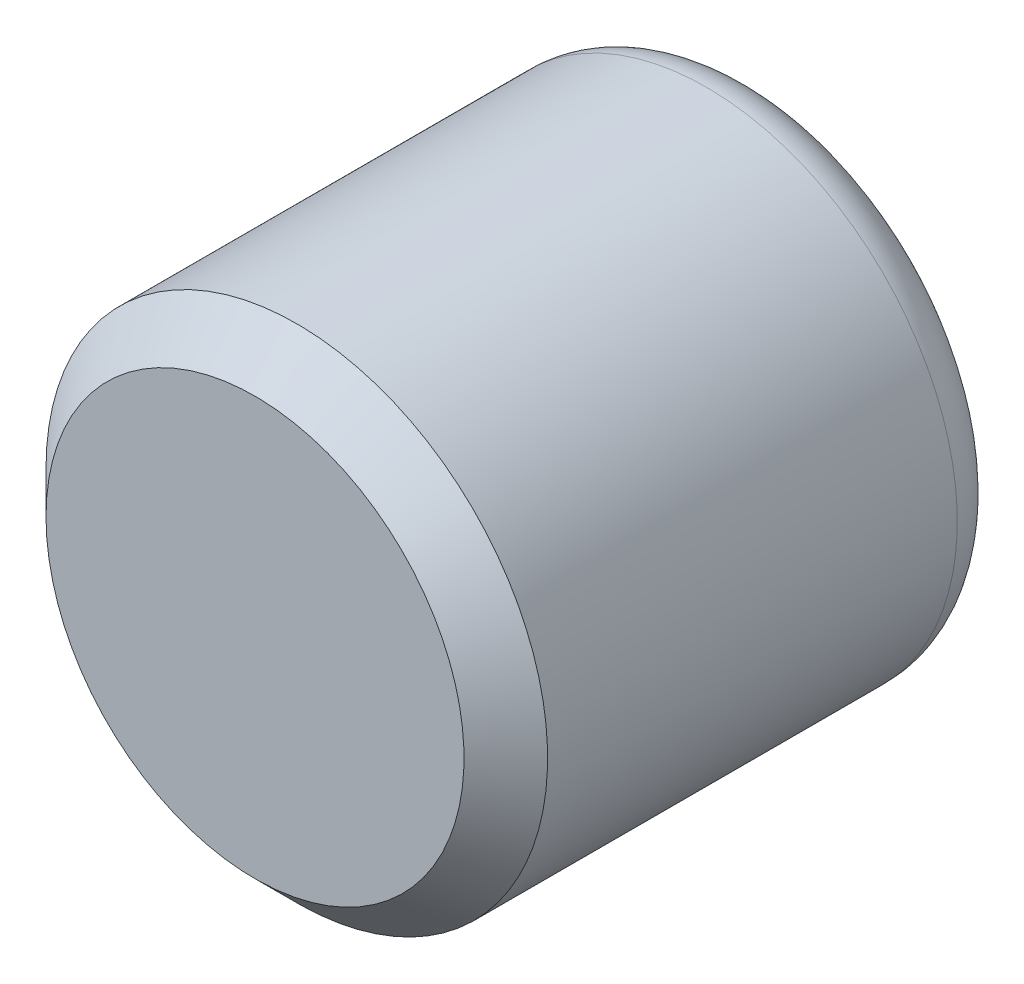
ISO-10303-21;
HEADER;
FILE_DESCRIPTION(('STEP AP214'),'2;1');
FILE_NAME('part.step','',(''),(''),'','','');
FILE_SCHEMA(('AUTOMOTIVE_DESIGN { 1 0 10303 214 1 1 1 1 }'));
ENDSEC;
DATA;
#1=APPLICATION_CONTEXT('core data for automotive mechanical design processes');
#2=APPLICATION_PROTOCOL_DEFINITION('international standard','automotive_design',2000,#1);
#3=PRODUCT_CONTEXT('',#1,'mechanical');
#4=PRODUCT('Part','Part','',(#3));
#5=PRODUCT_RELATED_PRODUCT_CATEGORY('part','',(#4));
#6=PRODUCT_DEFINITION_FORMATION('','',#4);
#7=PRODUCT_DEFINITION_CONTEXT('part definition',#1,'design');
#8=PRODUCT_DEFINITION('design','',#6,#7);
#9=PRODUCT_DEFINITION_SHAPE('','',#8);
#10=(LENGTH_UNIT() NAMED_UNIT(*) SI_UNIT(.MILLI.,.METRE.));
#11=(NAMED_UNIT(*) PLANE_ANGLE_UNIT() SI_UNIT($,.RADIAN.));
#12=(NAMED_UNIT(*) SI_UNIT($,.STERADIAN.) SOLID_ANGLE_UNIT());
#13=UNCERTAINTY_MEASURE_WITH_UNIT(LENGTH_MEASURE(1.E-05),#10,'distance_accuracy_value','');
#14=(GEOMETRIC_REPRESENTATION_CONTEXT(3) GLOBAL_UNCERTAINTY_ASSIGNED_CONTEXT((#13)) GLOBAL_UNIT_ASSIGNED_CONTEXT((#10,
#11,#12)) REPRESENTATION_CONTEXT('',''));
#15=CARTESIAN_POINT('',(0.,0.,0.));
#16=DIRECTION('',(0.,0.,1.));
#17=DIRECTION('',(1.,0.,0.));
#18=AXIS2_PLACEMENT_3D('',#15,#16,#17);
#19=CARTESIAN_POINT('',(0.,0.,-6.));
#20=DIRECTION('',(0.,0.,1.));
#21=DIRECTION('',(1.,0.,0.));
#22=AXIS2_PLACEMENT_3D('',#19,#20,#21);
#23=PLANE('',#22);
#24=CARTESIAN_POINT('',(0.,0.,-6.));
#25=DIRECTION('',(0.,0.,-1.));
#26=DIRECTION('',(-1.,0.,0.));
#27=AXIS2_PLACEMENT_3D('',#24,#25,#26);
#28=CIRCLE('',#27,2.4);
#29=CARTESIAN_POINT('',(-2.4,0.,-6.));
#30=VERTEX_POINT('',#29);
#31=EDGE_CURVE('E134',#30,#30,#28,.T.);
#32=ORIENTED_EDGE('',*,*,#31,.T.);
#33=EDGE_LOOP('',(#32));
#34=FACE_BOUND('',#33,.T.);
#35=DIRECTION('',(-0.86602540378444,0.499999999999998,0.));
#36=VECTOR('',#35,1.);
#37=CARTESIAN_POINT('',(0.,2.3094010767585,-6.));
#38=LINE('',#37,#36);
#39=CARTESIAN_POINT('',(2.,1.15470053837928,-6.));
#40=VERTEX_POINT('',#39);
#41=CARTESIAN_POINT('',(0.,2.3094010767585,-6.));
#42=VERTEX_POINT('',#41);
#43=EDGE_CURVE('E44',#40,#42,#38,.T.);
#44=ORIENTED_EDGE('',*,*,#43,.T.);
#45=DIRECTION('',(-0.866025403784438,-0.500000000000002,0.));
#46=VECTOR('',#45,1.);
#47=CARTESIAN_POINT('',(0.,2.3094010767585,-6.));
#48=LINE('',#47,#46);
#49=CARTESIAN_POINT('',(-1.99999999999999,1.15470053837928,-6.));
#50=VERTEX_POINT('',#49);
#51=EDGE_CURVE('E84',#42,#50,#48,.T.);
#52=ORIENTED_EDGE('',*,*,#51,.T.);
#53=DIRECTION('',(0.,-1.,0.));
#54=VECTOR('',#53,1.);
#55=CARTESIAN_POINT('',(-2.00000000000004,-1.15470053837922,-6.));
#56=LINE('',#55,#54);
#57=CARTESIAN_POINT('',(-2.00000000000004,-1.15470053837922,-6.));
#58=VERTEX_POINT('',#57);
#59=EDGE_CURVE('E92',#50,#58,#56,.T.);
#60=ORIENTED_EDGE('',*,*,#59,.T.);
#61=DIRECTION('',(0.866025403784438,-0.500000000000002,0.));
#62=VECTOR('',#61,1.);
#63=CARTESIAN_POINT('',(0.,-2.30940107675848,-6.));
#64=LINE('',#63,#62);
#65=CARTESIAN_POINT('',(0.,-2.30940107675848,-6.));
#66=VERTEX_POINT('',#65);
#67=EDGE_CURVE('E107',#58,#66,#64,.T.);
#68=ORIENTED_EDGE('',*,*,#67,.T.);
#69=DIRECTION('',(0.866025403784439,0.499999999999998,0.));
#70=VECTOR('',#69,1.);
#71=CARTESIAN_POINT('',(0.,-2.30940107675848,-6.));
#72=LINE('',#71,#70);
#73=CARTESIAN_POINT('',(1.99999999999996,-1.15470053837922,-6.));
#74=VERTEX_POINT('',#73);
#75=EDGE_CURVE('E110',#66,#74,#72,.T.);
#76=ORIENTED_EDGE('',*,*,#75,.T.);
#77=DIRECTION('',(0.,1.,0.));
#78=VECTOR('',#77,1.);
#79=CARTESIAN_POINT('',(1.99999999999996,-1.15470053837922,-6.));
#80=LINE('',#79,#78);
#81=EDGE_CURVE('E103',#74,#40,#80,.T.);
#82=ORIENTED_EDGE('',*,*,#81,.T.);
#83=EDGE_LOOP('',(#44,#52,#60,#68,#76,#82));
#84=FACE_BOUND('',#83,.T.);
#85=ADVANCED_FACE('F30',(#34,#84),#23,.F.);
#86=CARTESIAN_POINT('',(0.,0.,-5.4));
#87=DIRECTION('',(0.,0.,-1.));
#88=DIRECTION('',(-1.,0.,0.));
#89=AXIS2_PLACEMENT_3D('',#86,#87,#88);
#90=TOROIDAL_SURFACE('',#89,2.4,0.599999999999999);
#91=ORIENTED_EDGE('',*,*,#31,.F.);
#92=EDGE_LOOP('',(#91));
#93=FACE_BOUND('',#92,.T.);
#94=CARTESIAN_POINT('',(0.,0.,-5.4));
#95=DIRECTION('',(0.,0.,-1.));
#96=DIRECTION('',(-1.,0.,0.));
#97=AXIS2_PLACEMENT_3D('',#94,#95,#96);
#98=CIRCLE('',#97,3.);
#99=CARTESIAN_POINT('',(-3.,0.,-5.4));
#100=VERTEX_POINT('',#99);
#101=EDGE_CURVE('E98',#100,#100,#98,.T.);
#102=ORIENTED_EDGE('',*,*,#101,.T.);
#103=EDGE_LOOP('',(#102));
#104=FACE_BOUND('',#103,.T.);
#105=ADVANCED_FACE('F155',(#93,#104),#90,.T.);
#106=CARTESIAN_POINT('',(0.,0.,0.));
#107=DIRECTION('',(0.,0.,-1.));
#108=DIRECTION('',(-1.,0.,0.));
#109=AXIS2_PLACEMENT_3D('',#106,#107,#108);
#110=CYLINDRICAL_SURFACE('',#109,3.);
#111=CARTESIAN_POINT('',(0.,0.,-0.5));
#112=DIRECTION('',(0.,0.,-1.));
#113=DIRECTION('',(-1.,0.,0.));
#114=AXIS2_PLACEMENT_3D('',#111,#112,#113);
#115=CIRCLE('',#114,3.);
#116=CARTESIAN_POINT('',(-3.,0.,-0.5));
#117=VERTEX_POINT('',#116);
#118=EDGE_CURVE('E37',#117,#117,#115,.T.);
#119=ORIENTED_EDGE('',*,*,#118,.T.);
#120=EDGE_LOOP('',(#119));
#121=FACE_BOUND('',#120,.T.);
#122=ORIENTED_EDGE('',*,*,#101,.F.);
#123=EDGE_LOOP('',(#122));
#124=FACE_BOUND('',#123,.T.);
#125=ADVANCED_FACE('F139',(#121,#124),#110,.T.);
#126=CARTESIAN_POINT('',(0.,0.,0.));
#127=DIRECTION('',(0.,0.,-1.));
#128=DIRECTION('',(-1.,0.,0.));
#129=AXIS2_PLACEMENT_3D('',#126,#127,#128);
#130=PLANE('',#129);
#131=CARTESIAN_POINT('',(0.,0.,0.));
#132=DIRECTION('',(0.,0.,-1.));
#133=DIRECTION('',(-1.,0.,0.));
#134=AXIS2_PLACEMENT_3D('',#131,#132,#133);
#135=CIRCLE('',#134,2.5);
#136=CARTESIAN_POINT('',(-2.5,0.,0.));
#137=VERTEX_POINT('',#136);
#138=EDGE_CURVE('E11',#137,#137,#135,.F.);
#139=ORIENTED_EDGE('',*,*,#138,.T.);
#140=EDGE_LOOP('',(#139));
#141=FACE_BOUND('',#140,.T.);
#142=ADVANCED_FACE('F165',(#141),#130,.F.);
#143=CARTESIAN_POINT('',(0.,2.30940107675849,-2.00000000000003));
#144=DIRECTION('',(-0.499999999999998,-0.86602540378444,0.));
#145=DIRECTION('',(0.86602540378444,-0.499999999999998,0.));
#146=AXIS2_PLACEMENT_3D('',#143,#144,#145);
#147=PLANE('',#146);
#148=ORIENTED_EDGE('',*,*,#43,.F.);
#149=DIRECTION('',(0.,0.,-1.));
#150=VECTOR('',#149,1.);
#151=CARTESIAN_POINT('',(2.,1.15470053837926,-2.));
#152=LINE('',#151,#150);
#153=CARTESIAN_POINT('',(2.,1.15470053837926,-2.));
#154=VERTEX_POINT('',#153);
#155=EDGE_CURVE('E123',#154,#40,#152,.T.);
#156=ORIENTED_EDGE('',*,*,#155,.F.);
#157=DIRECTION('',(-0.86602540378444,0.499999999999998,0.));
#158=VECTOR('',#157,1.);
#159=CARTESIAN_POINT('',(0.,2.30940107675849,-2.00000000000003));
#160=LINE('',#159,#158);
#161=CARTESIAN_POINT('',(0.,2.30940107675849,-2.00000000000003));
#162=VERTEX_POINT('',#161);
#163=EDGE_CURVE('E97',#154,#162,#160,.T.);
#164=ORIENTED_EDGE('',*,*,#163,.T.);
#165=DIRECTION('',(0.,0.,-1.));
#166=VECTOR('',#165,1.);
#167=CARTESIAN_POINT('',(0.,2.30940107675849,-2.00000000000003));
#168=LINE('',#167,#166);
#169=EDGE_CURVE('E86',#162,#42,#168,.T.);
#170=ORIENTED_EDGE('',*,*,#169,.T.);
#171=EDGE_LOOP('',(#148,#156,#164,#170));
#172=FACE_BOUND('',#171,.T.);
#173=ADVANCED_FACE('F95',(#172),#147,.T.);
#174=CARTESIAN_POINT('',(0.,2.30940107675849,-2.00000000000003));
#175=DIRECTION('',(0.500000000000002,-0.866025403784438,0.));
#176=DIRECTION('',(0.866025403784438,0.500000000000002,0.));
#177=AXIS2_PLACEMENT_3D('',#174,#175,#176);
#178=PLANE('',#177);
#179=ORIENTED_EDGE('',*,*,#51,.F.);
#180=ORIENTED_EDGE('',*,*,#169,.F.);
#181=DIRECTION('',(-0.866025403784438,-0.500000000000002,0.));
#182=VECTOR('',#181,1.);
#183=CARTESIAN_POINT('',(0.,2.30940107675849,-2.00000000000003));
#184=LINE('',#183,#182);
#185=CARTESIAN_POINT('',(-1.99999999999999,1.15470053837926,-2.00000000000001));
#186=VERTEX_POINT('',#185);
#187=EDGE_CURVE('E114',#162,#186,#184,.T.);
#188=ORIENTED_EDGE('',*,*,#187,.T.);
#189=DIRECTION('',(0.,0.,-1.));
#190=VECTOR('',#189,1.);
#191=CARTESIAN_POINT('',(-1.99999999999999,1.15470053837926,-2.00000000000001));
#192=LINE('',#191,#190);
#193=EDGE_CURVE('E88',#186,#50,#192,.T.);
#194=ORIENTED_EDGE('',*,*,#193,.T.);
#195=EDGE_LOOP('',(#179,#180,#188,#194));
#196=FACE_BOUND('',#195,.T.);
#197=ADVANCED_FACE('F85',(#196),#178,.T.);
#198=CARTESIAN_POINT('',(-2.0000000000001,-1.15470053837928,-2.));
#199=DIRECTION('',(1.,0.,0.));
#200=DIRECTION('',(0.,0.,-1.));
#201=AXIS2_PLACEMENT_3D('',#198,#199,#200);
#202=PLANE('',#201);
#203=ORIENTED_EDGE('',*,*,#59,.F.);
#204=ORIENTED_EDGE('',*,*,#193,.F.);
#205=DIRECTION('',(0.,-1.,0.));
#206=VECTOR('',#205,1.);
#207=CARTESIAN_POINT('',(-2.0000000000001,-1.15470053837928,-2.));
#208=LINE('',#207,#206);
#209=CARTESIAN_POINT('',(-2.0000000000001,-1.15470053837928,-2.));
#210=VERTEX_POINT('',#209);
#211=EDGE_CURVE('E116',#186,#210,#208,.T.);
#212=ORIENTED_EDGE('',*,*,#211,.T.);
#213=DIRECTION('',(0.,0.,-1.));
#214=VECTOR('',#213,1.);
#215=CARTESIAN_POINT('',(-2.0000000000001,-1.15470053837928,-2.));
#216=LINE('',#215,#214);
#217=EDGE_CURVE('E129',#210,#58,#216,.T.);
#218=ORIENTED_EDGE('',*,*,#217,.T.);
#219=EDGE_LOOP('',(#203,#204,#212,#218));
#220=FACE_BOUND('',#219,.T.);
#221=ADVANCED_FACE('F177',(#220),#202,.T.);
#222=CARTESIAN_POINT('',(0.,-2.30940107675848,-1.99999999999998));
#223=DIRECTION('',(0.500000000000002,0.866025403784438,0.));
#224=DIRECTION('',(-0.866025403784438,0.500000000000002,0.));
#225=AXIS2_PLACEMENT_3D('',#222,#223,#224);
#226=PLANE('',#225);
#227=ORIENTED_EDGE('',*,*,#67,.F.);
#228=ORIENTED_EDGE('',*,*,#217,.F.);
#229=DIRECTION('',(0.866025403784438,-0.500000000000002,0.));
#230=VECTOR('',#229,1.);
#231=CARTESIAN_POINT('',(0.,-2.30940107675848,-1.99999999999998));
#232=LINE('',#231,#230);
#233=CARTESIAN_POINT('',(0.,-2.30940107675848,-1.99999999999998));
#234=VERTEX_POINT('',#233);
#235=EDGE_CURVE('E118',#210,#234,#232,.T.);
#236=ORIENTED_EDGE('',*,*,#235,.T.);
#237=DIRECTION('',(0.,0.,-1.));
#238=VECTOR('',#237,1.);
#239=CARTESIAN_POINT('',(0.,-2.30940107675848,-1.99999999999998));
#240=LINE('',#239,#238);
#241=EDGE_CURVE('E127',#234,#66,#240,.T.);
#242=ORIENTED_EDGE('',*,*,#241,.T.);
#243=EDGE_LOOP('',(#227,#228,#236,#242));
#244=FACE_BOUND('',#243,.T.);
#245=ADVANCED_FACE('F180',(#244),#226,.T.);
#246=CARTESIAN_POINT('',(0.,-2.30940107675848,-1.99999999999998));
#247=DIRECTION('',(-0.499999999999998,0.866025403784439,0.));
#248=DIRECTION('',(-0.866025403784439,-0.499999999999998,0.));
#249=AXIS2_PLACEMENT_3D('',#246,#247,#248);
#250=PLANE('',#249);
#251=ORIENTED_EDGE('',*,*,#75,.F.);
#252=ORIENTED_EDGE('',*,*,#241,.F.);
#253=DIRECTION('',(0.866025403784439,0.499999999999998,0.));
#254=VECTOR('',#253,1.);
#255=CARTESIAN_POINT('',(0.,-2.30940107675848,-1.99999999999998));
#256=LINE('',#255,#254);
#257=CARTESIAN_POINT('',(1.99999999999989,-1.15470053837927,-1.99999999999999));
#258=VERTEX_POINT('',#257);
#259=EDGE_CURVE('E120',#234,#258,#256,.T.);
#260=ORIENTED_EDGE('',*,*,#259,.T.);
#261=DIRECTION('',(0.,0.,-1.));
#262=VECTOR('',#261,1.);
#263=CARTESIAN_POINT('',(1.99999999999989,-1.15470053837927,-1.99999999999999));
#264=LINE('',#263,#262);
#265=EDGE_CURVE('E125',#258,#74,#264,.T.);
#266=ORIENTED_EDGE('',*,*,#265,.T.);
#267=EDGE_LOOP('',(#251,#252,#260,#266));
#268=FACE_BOUND('',#267,.T.);
#269=ADVANCED_FACE('F184',(#268),#250,.T.);
#270=CARTESIAN_POINT('',(1.99999999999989,-1.15470053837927,-1.99999999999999));
#271=DIRECTION('',(-1.,0.,0.));
#272=DIRECTION('',(0.,0.,1.));
#273=AXIS2_PLACEMENT_3D('',#270,#271,#272);
#274=PLANE('',#273);
#275=ORIENTED_EDGE('',*,*,#81,.F.);
#276=ORIENTED_EDGE('',*,*,#265,.F.);
#277=DIRECTION('',(0.,1.,0.));
#278=VECTOR('',#277,1.);
#279=CARTESIAN_POINT('',(1.99999999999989,-1.15470053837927,-1.99999999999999));
#280=LINE('',#279,#278);
#281=EDGE_CURVE('E51',#258,#154,#280,.T.);
#282=ORIENTED_EDGE('',*,*,#281,.T.);
#283=ORIENTED_EDGE('',*,*,#155,.T.);
#284=EDGE_LOOP('',(#275,#276,#282,#283));
#285=FACE_BOUND('',#284,.T.);
#286=ADVANCED_FACE('F150',(#285),#274,.T.);
#287=CARTESIAN_POINT('',(2.,1.15470053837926,-2.));
#288=DIRECTION('',(0.,0.,1.));
#289=DIRECTION('',(1.,0.,0.));
#290=AXIS2_PLACEMENT_3D('',#287,#288,#289);
#291=PLANE('',#290);
#292=ORIENTED_EDGE('',*,*,#163,.F.);
#293=ORIENTED_EDGE('',*,*,#281,.F.);
#294=ORIENTED_EDGE('',*,*,#259,.F.);
#295=ORIENTED_EDGE('',*,*,#235,.F.);
#296=ORIENTED_EDGE('',*,*,#211,.F.);
#297=ORIENTED_EDGE('',*,*,#187,.F.);
#298=EDGE_LOOP('',(#292,#293,#294,#295,#296,#297));
#299=FACE_BOUND('',#298,.T.);
#300=ADVANCED_FACE('F144',(#299),#291,.F.);
#301=CARTESIAN_POINT('',(0.,0.,-0.5));
#302=DIRECTION('',(0.,0.,-1.));
#303=DIRECTION('',(-1.,0.,0.));
#304=AXIS2_PLACEMENT_3D('',#301,#302,#303);
#305=CONICAL_SURFACE('',#304,3.,0.78539816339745);
#306=ORIENTED_EDGE('',*,*,#138,.F.);
#307=EDGE_LOOP('',(#306));
#308=FACE_BOUND('',#307,.T.);
#309=ORIENTED_EDGE('',*,*,#118,.F.);
#310=EDGE_LOOP('',(#309));
#311=FACE_BOUND('',#310,.T.);
#312=ADVANCED_FACE('F142',(#308,#311),#305,.T.);
#313=CLOSED_SHELL('',(#85,#105,#125,#142,#173,#197,#221,#245,#269,#286,#300,#312));
#314=MANIFOLD_SOLID_BREP('B2',#313);
#315=ADVANCED_BREP_SHAPE_REPRESENTATION('',(#18,#314),#14);
#316=SHAPE_DEFINITION_REPRESENTATION(#9,#315);
ENDSEC;
END-ISO-10303-21;
